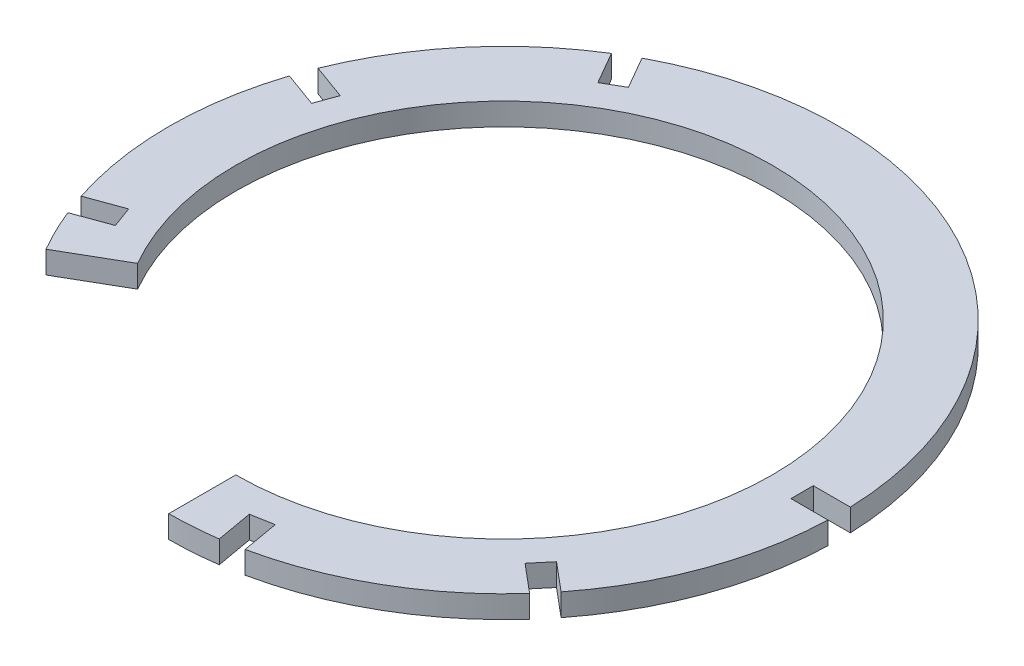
ISO-10303-21;
HEADER;
FILE_DESCRIPTION(('STEP AP214'),'2;1');
FILE_NAME('part.step','',(''),(''),'','','');
FILE_SCHEMA(('AUTOMOTIVE_DESIGN { 1 0 10303 214 1 1 1 1 }'));
ENDSEC;
DATA;
#1=APPLICATION_CONTEXT('core data for automotive mechanical design processes');
#2=APPLICATION_PROTOCOL_DEFINITION('international standard','automotive_design',2000,#1);
#3=PRODUCT_CONTEXT('',#1,'mechanical');
#4=PRODUCT('Part','Part','',(#3));
#5=PRODUCT_RELATED_PRODUCT_CATEGORY('part','',(#4));
#6=PRODUCT_DEFINITION_FORMATION('','',#4);
#7=PRODUCT_DEFINITION_CONTEXT('part definition',#1,'design');
#8=PRODUCT_DEFINITION('design','',#6,#7);
#9=PRODUCT_DEFINITION_SHAPE('','',#8);
#10=(LENGTH_UNIT() NAMED_UNIT(*) SI_UNIT(.MILLI.,.METRE.));
#11=(NAMED_UNIT(*) PLANE_ANGLE_UNIT() SI_UNIT($,.RADIAN.));
#12=(NAMED_UNIT(*) SI_UNIT($,.STERADIAN.) SOLID_ANGLE_UNIT());
#13=UNCERTAINTY_MEASURE_WITH_UNIT(LENGTH_MEASURE(1.E-05),#10,'distance_accuracy_value','');
#14=(GEOMETRIC_REPRESENTATION_CONTEXT(3) GLOBAL_UNCERTAINTY_ASSIGNED_CONTEXT((#13)) GLOBAL_UNIT_ASSIGNED_CONTEXT((#10,
#11,#12)) REPRESENTATION_CONTEXT('',''));
#15=CARTESIAN_POINT('',(0.,0.,0.));
#16=DIRECTION('',(0.,0.,1.));
#17=DIRECTION('',(1.,0.,0.));
#18=AXIS2_PLACEMENT_3D('',#15,#16,#17);
#19=CARTESIAN_POINT('',(0.,15.,0.));
#20=DIRECTION('',(0.,-1.,0.));
#21=DIRECTION('',(0.,0.,-1.));
#22=AXIS2_PLACEMENT_3D('',#19,#20,#21);
#23=CYLINDRICAL_SURFACE('',#22,225.);
#24=DIRECTION('',(0.,-1.,0.));
#25=VECTOR('',#24,1.);
#26=CARTESIAN_POINT('',(-213.878496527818,15.,-69.864073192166));
#27=LINE('',#26,#25);
#28=CARTESIAN_POINT('',(-213.878496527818,0.,-69.864073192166));
#29=VERTEX_POINT('',#28);
#30=CARTESIAN_POINT('',(-213.878496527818,15.,-69.864073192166));
#31=VERTEX_POINT('',#30);
#32=EDGE_CURVE('E338',#29,#31,#27,.F.);
#33=ORIENTED_EDGE('',*,*,#32,.F.);
#34=CARTESIAN_POINT('',(0.,0.,0.));
#35=DIRECTION('',(0.,1.,0.));
#36=DIRECTION('',(0.,0.,1.));
#37=AXIS2_PLACEMENT_3D('',#34,#35,#36);
#38=CIRCLE('',#37,225.);
#39=CARTESIAN_POINT('',(-213.878496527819,0.,69.8640731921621));
#40=VERTEX_POINT('',#39);
#41=EDGE_CURVE('E461',#29,#40,#38,.T.);
#42=ORIENTED_EDGE('',*,*,#41,.T.);
#43=DIRECTION('',(0.,-1.,0.));
#44=VECTOR('',#43,1.);
#45=CARTESIAN_POINT('',(-213.878496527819,15.,69.8640731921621));
#46=LINE('',#45,#44);
#47=CARTESIAN_POINT('',(-213.878496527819,15.,69.8640731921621));
#48=VERTEX_POINT('',#47);
#49=EDGE_CURVE('E48',#40,#48,#46,.F.);
#50=ORIENTED_EDGE('',*,*,#49,.T.);
#51=CARTESIAN_POINT('',(0.,15.,0.));
#52=DIRECTION('',(0.,1.,0.));
#53=DIRECTION('',(0.,0.,1.));
#54=AXIS2_PLACEMENT_3D('',#51,#52,#53);
#55=CIRCLE('',#54,225.);
#56=EDGE_CURVE('E447',#31,#48,#55,.T.);
#57=ORIENTED_EDGE('',*,*,#56,.F.);
#58=EDGE_LOOP('',(#33,#42,#50,#57));
#59=FACE_BOUND('',#58,.T.);
#60=ADVANCED_FACE('F33',(#59),#23,.T.);
#61=CARTESIAN_POINT('',(-118.932673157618,0.,-190.997432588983));
#62=VERTEX_POINT('',#61);
#63=CARTESIAN_POINT('',(-208.748194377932,0.,-83.9594625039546));
#64=VERTEX_POINT('',#63);
#65=EDGE_CURVE('E463',#62,#64,#38,.T.);
#66=ORIENTED_EDGE('',*,*,#65,.T.);
#67=DIRECTION('',(0.,-1.,0.));
#68=VECTOR('',#67,1.);
#69=CARTESIAN_POINT('',(-208.748194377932,15.,-83.9594625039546));
#70=LINE('',#69,#68);
#71=CARTESIAN_POINT('',(-208.748194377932,15.,-83.9594625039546));
#72=VERTEX_POINT('',#71);
#73=EDGE_CURVE('E56',#64,#72,#70,.F.);
#74=ORIENTED_EDGE('',*,*,#73,.T.);
#75=CARTESIAN_POINT('',(-118.932673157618,15.,-190.997432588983));
#76=VERTEX_POINT('',#75);
#77=EDGE_CURVE('E442',#76,#72,#55,.T.);
#78=ORIENTED_EDGE('',*,*,#77,.F.);
#79=DIRECTION('',(0.,-1.,0.));
#80=VECTOR('',#79,1.);
#81=CARTESIAN_POINT('',(-118.932673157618,15.,-190.997432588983));
#82=LINE('',#81,#80);
#83=EDGE_CURVE('E335',#62,#76,#82,.F.);
#84=ORIENTED_EDGE('',*,*,#83,.F.);
#85=EDGE_LOOP('',(#66,#74,#78,#84));
#86=FACE_BOUND('',#85,.T.);
#87=ADVANCED_FACE('F517',(#86),#23,.T.);
#88=DIRECTION('',(0.,-1.,0.));
#89=VECTOR('',#88,1.);
#90=CARTESIAN_POINT('',(-208.748194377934,15.,83.9594625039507));
#91=LINE('',#90,#89);
#92=CARTESIAN_POINT('',(-208.748194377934,0.,83.9594625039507));
#93=VERTEX_POINT('',#92);
#94=CARTESIAN_POINT('',(-208.748194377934,15.,83.9594625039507));
#95=VERTEX_POINT('',#94);
#96=EDGE_CURVE('E236',#93,#95,#91,.F.);
#97=ORIENTED_EDGE('',*,*,#96,.F.);
#98=CARTESIAN_POINT('',(-194.855715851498,0.,112.500000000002));
#99=VERTEX_POINT('',#98);
#100=EDGE_CURVE('E386',#93,#99,#38,.T.);
#101=ORIENTED_EDGE('',*,*,#100,.T.);
#102=DIRECTION('',(0.,-1.,0.));
#103=VECTOR('',#102,1.);
#104=CARTESIAN_POINT('',(-194.855715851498,15.,112.500000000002));
#105=LINE('',#104,#103);
#106=CARTESIAN_POINT('',(-194.855715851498,15.,112.500000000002));
#107=VERTEX_POINT('',#106);
#108=EDGE_CURVE('E395',#107,#99,#105,.T.);
#109=ORIENTED_EDGE('',*,*,#108,.F.);
#110=EDGE_CURVE('E373',#95,#107,#55,.T.);
#111=ORIENTED_EDGE('',*,*,#110,.F.);
#112=EDGE_LOOP('',(#97,#101,#109,#111));
#113=FACE_BOUND('',#112,.T.);
#114=ADVANCED_FACE('F455',(#113),#23,.T.);
#115=CARTESIAN_POINT('',(0.,15.,0.));
#116=DIRECTION('',(0.,1.,0.));
#117=DIRECTION('',(0.,0.,1.));
#118=AXIS2_PLACEMENT_3D('',#115,#116,#117);
#119=PLANE('',#118);
#120=DIRECTION('',(0.342020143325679,0.,-0.939692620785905));
#121=VECTOR('',#120,1.);
#122=CARTESIAN_POINT('',(-190.503675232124,15.,-61.3563340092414));
#123=LINE('',#122,#121);
#124=CARTESIAN_POINT('',(-190.503675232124,15.,-61.3563340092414));
#125=VERTEX_POINT('',#124);
#126=CARTESIAN_POINT('',(-185.373373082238,15.,-75.4517233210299));
#127=VERTEX_POINT('',#126);
#128=EDGE_CURVE('E230',#125,#127,#123,.T.);
#129=ORIENTED_EDGE('',*,*,#128,.F.);
#130=DIRECTION('',(-0.939692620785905,0.,-0.342020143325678));
#131=VECTOR('',#130,1.);
#132=CARTESIAN_POINT('',(-190.503675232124,15.,-61.3563340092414));
#133=LINE('',#132,#131);
#134=EDGE_CURVE('E280',#125,#31,#133,.T.);
#135=ORIENTED_EDGE('',*,*,#134,.T.);
#136=ORIENTED_EDGE('',*,*,#56,.T.);
#137=DIRECTION('',(-0.939692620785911,0.,0.342020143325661));
#138=VECTOR('',#137,1.);
#139=CARTESIAN_POINT('',(-190.503675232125,15.,61.3563340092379));
#140=LINE('',#139,#138);
#141=CARTESIAN_POINT('',(-190.503675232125,15.,61.3563340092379));
#142=VERTEX_POINT('',#141);
#143=EDGE_CURVE('E239',#142,#48,#140,.T.);
#144=ORIENTED_EDGE('',*,*,#143,.F.);
#145=DIRECTION('',(-0.342020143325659,0.,-0.939692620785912));
#146=VECTOR('',#145,1.);
#147=CARTESIAN_POINT('',(-185.37337308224,15.,75.4517233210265));
#148=LINE('',#147,#146);
#149=CARTESIAN_POINT('',(-185.37337308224,15.,75.4517233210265));
#150=VERTEX_POINT('',#149);
#151=EDGE_CURVE('E223',#150,#142,#148,.T.);
#152=ORIENTED_EDGE('',*,*,#151,.F.);
#153=DIRECTION('',(-0.939692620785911,0.,0.342020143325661));
#154=VECTOR('',#153,1.);
#155=CARTESIAN_POINT('',(-185.37337308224,15.,75.4517233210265));
#156=LINE('',#155,#154);
#157=EDGE_CURVE('E233',#150,#95,#156,.T.);
#158=ORIENTED_EDGE('',*,*,#157,.T.);
#159=ORIENTED_EDGE('',*,*,#110,.T.);
#160=DIRECTION('',(0.866025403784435,0.,-0.500000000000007));
#161=VECTOR('',#160,1.);
#162=CARTESIAN_POINT('',(-155.884572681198,15.,90.0000000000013));
#163=LINE('',#162,#161);
#164=CARTESIAN_POINT('',(-155.884572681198,15.,90.0000000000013));
#165=VERTEX_POINT('',#164);
#166=EDGE_CURVE('E377',#107,#165,#163,.T.);
#167=ORIENTED_EDGE('',*,*,#166,.T.);
#168=CARTESIAN_POINT('',(0.,15.,0.));
#169=DIRECTION('',(0.,-1.,0.));
#170=DIRECTION('',(0.,0.,1.));
#171=AXIS2_PLACEMENT_3D('',#168,#169,#170);
#172=CIRCLE('',#171,180.);
#173=CARTESIAN_POINT('',(1.96370697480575E-12,15.,180.));
#174=VERTEX_POINT('',#173);
#175=EDGE_CURVE('E367',#165,#174,#172,.T.);
#176=ORIENTED_EDGE('',*,*,#175,.T.);
#177=DIRECTION('',(0.,0.,1.));
#178=VECTOR('',#177,1.);
#179=CARTESIAN_POINT('',(1.96370697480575E-12,15.,180.));
#180=LINE('',#179,#178);
#181=CARTESIAN_POINT('',(2.45456432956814E-12,15.,225.));
#182=VERTEX_POINT('',#181);
#183=EDGE_CURVE('E370',#174,#182,#180,.T.);
#184=ORIENTED_EDGE('',*,*,#183,.T.);
#185=CARTESIAN_POINT('',(31.6630697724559,15.,222.760970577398));
#186=VERTEX_POINT('',#185);
#187=EDGE_CURVE('E374',#182,#186,#55,.T.);
#188=ORIENTED_EDGE('',*,*,#187,.T.);
#189=DIRECTION('',(0.173648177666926,0.,0.984807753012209));
#190=VECTOR('',#189,1.);
#191=CARTESIAN_POINT('',(27.3435773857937,15.,198.263911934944));
#192=LINE('',#191,#190);
#193=CARTESIAN_POINT('',(27.3435773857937,15.,198.263911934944));
#194=VERTEX_POINT('',#193);
#195=EDGE_CURVE('E319',#194,#186,#192,.T.);
#196=ORIENTED_EDGE('',*,*,#195,.F.);
#197=DIRECTION('',(-0.984807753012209,0.,0.173648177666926));
#198=VECTOR('',#197,1.);
#199=CARTESIAN_POINT('',(42.1156936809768,15.,195.65918926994));
#200=LINE('',#199,#198);
#201=CARTESIAN_POINT('',(42.1156936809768,15.,195.65918926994));
#202=VERTEX_POINT('',#201);
#203=EDGE_CURVE('E298',#202,#194,#200,.T.);
#204=ORIENTED_EDGE('',*,*,#203,.F.);
#205=DIRECTION('',(0.173648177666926,0.,0.984807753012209));
#206=VECTOR('',#205,1.);
#207=CARTESIAN_POINT('',(42.1156936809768,15.,195.65918926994));
#208=LINE('',#207,#206);
#209=CARTESIAN_POINT('',(46.435186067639,15.,220.156247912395));
#210=VERTEX_POINT('',#209);
#211=EDGE_CURVE('E316',#202,#210,#208,.T.);
#212=ORIENTED_EDGE('',*,*,#211,.T.);
#213=CARTESIAN_POINT('',(167.443310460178,15.,150.292174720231));
#214=VERTEX_POINT('',#213);
#215=EDGE_CURVE('E378',#210,#214,#55,.T.);
#216=ORIENTED_EDGE('',*,*,#215,.T.);
#217=DIRECTION('',(0.766044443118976,0.,0.642787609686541));
#218=VECTOR('',#217,1.);
#219=CARTESIAN_POINT('',(148.387981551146,15.,134.302855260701));
#220=LINE('',#219,#218);
#221=CARTESIAN_POINT('',(148.387981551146,15.,134.302855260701));
#222=VERTEX_POINT('',#221);
#223=EDGE_CURVE('E302',#222,#214,#220,.T.);
#224=ORIENTED_EDGE('',*,*,#223,.F.);
#225=DIRECTION('',(-0.642787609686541,0.,0.766044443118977));
#226=VECTOR('',#225,1.);
#227=CARTESIAN_POINT('',(158.029795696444,15.,122.812188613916));
#228=LINE('',#227,#226);
#229=CARTESIAN_POINT('',(158.029795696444,15.,122.812188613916));
#230=VERTEX_POINT('',#229);
#231=EDGE_CURVE('E305',#230,#222,#228,.T.);
#232=ORIENTED_EDGE('',*,*,#231,.F.);
#233=DIRECTION('',(0.766044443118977,0.,0.642787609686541));
#234=VECTOR('',#233,1.);
#235=CARTESIAN_POINT('',(158.029795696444,15.,122.812188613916));
#236=LINE('',#235,#234);
#237=CARTESIAN_POINT('',(177.085124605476,15.,138.801508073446));
#238=VERTEX_POINT('',#237);
#239=EDGE_CURVE('E299',#230,#238,#236,.T.);
#240=ORIENTED_EDGE('',*,*,#239,.T.);
#241=CARTESIAN_POINT('',(224.874965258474,15.,7.5));
#242=VERTEX_POINT('',#241);
#243=EDGE_CURVE('E441',#238,#242,#55,.T.);
#244=ORIENTED_EDGE('',*,*,#243,.T.);
#245=DIRECTION('',(1.,0.,0.));
#246=VECTOR('',#245,1.);
#247=CARTESIAN_POINT('',(200.,15.,7.5));
#248=LINE('',#247,#246);
#249=CARTESIAN_POINT('',(200.,15.,7.5));
#250=VERTEX_POINT('',#249);
#251=EDGE_CURVE('E353',#250,#242,#248,.T.);
#252=ORIENTED_EDGE('',*,*,#251,.F.);
#253=DIRECTION('',(0.,0.,1.));
#254=VECTOR('',#253,1.);
#255=CARTESIAN_POINT('',(200.,15.,-7.5));
#256=LINE('',#255,#254);
#257=CARTESIAN_POINT('',(200.,15.,-7.5));
#258=VERTEX_POINT('',#257);
#259=EDGE_CURVE('E340',#258,#250,#256,.T.);
#260=ORIENTED_EDGE('',*,*,#259,.F.);
#261=DIRECTION('',(1.,0.,0.));
#262=VECTOR('',#261,1.);
#263=CARTESIAN_POINT('',(200.,15.,-7.5));
#264=LINE('',#263,#262);
#265=CARTESIAN_POINT('',(224.874965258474,15.,-7.5));
#266=VERTEX_POINT('',#265);
#267=EDGE_CURVE('E345',#258,#266,#264,.T.);
#268=ORIENTED_EDGE('',*,*,#267,.T.);
#269=CARTESIAN_POINT('',(-105.942292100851,15.,-198.497432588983));
#270=VERTEX_POINT('',#269);
#271=EDGE_CURVE('E379',#266,#270,#55,.T.);
#272=ORIENTED_EDGE('',*,*,#271,.T.);
#273=DIRECTION('',(-0.499999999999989,0.,-0.866025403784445));
#274=VECTOR('',#273,1.);
#275=CARTESIAN_POINT('',(-93.5048094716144,15.,-176.955080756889));
#276=LINE('',#275,#274);
#277=CARTESIAN_POINT('',(-93.5048094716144,15.,-176.955080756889));
#278=VERTEX_POINT('',#277);
#279=EDGE_CURVE('E263',#278,#270,#276,.T.);
#280=ORIENTED_EDGE('',*,*,#279,.F.);
#281=DIRECTION('',(0.866025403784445,0.,-0.499999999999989));
#282=VECTOR('',#281,1.);
#283=CARTESIAN_POINT('',(-106.495190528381,15.,-169.455080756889));
#284=LINE('',#283,#282);
#285=CARTESIAN_POINT('',(-106.495190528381,15.,-169.455080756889));
#286=VERTEX_POINT('',#285);
#287=EDGE_CURVE('E266',#286,#278,#284,.T.);
#288=ORIENTED_EDGE('',*,*,#287,.F.);
#289=DIRECTION('',(-0.499999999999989,0.,-0.866025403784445));
#290=VECTOR('',#289,1.);
#291=CARTESIAN_POINT('',(-106.495190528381,15.,-169.455080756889));
#292=LINE('',#291,#290);
#293=EDGE_CURVE('E260',#286,#76,#292,.T.);
#294=ORIENTED_EDGE('',*,*,#293,.T.);
#295=ORIENTED_EDGE('',*,*,#77,.T.);
#296=DIRECTION('',(-0.939692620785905,0.,-0.342020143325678));
#297=VECTOR('',#296,1.);
#298=CARTESIAN_POINT('',(-185.373373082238,15.,-75.4517233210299));
#299=LINE('',#298,#297);
#300=EDGE_CURVE('E283',#127,#72,#299,.T.);
#301=ORIENTED_EDGE('',*,*,#300,.F.);
#302=EDGE_LOOP('',(#129,#135,#136,#144,#152,#158,#159,#167,#176,#184,#188,#196,#204,#212,#216,
#224,#232,#240,#244,#252,#260,#268,#272,#280,#288,#294,#295,#301));
#303=FACE_BOUND('',#302,.T.);
#304=ADVANCED_FACE('F242',(#303),#119,.T.);
#305=CARTESIAN_POINT('',(0.,0.,0.));
#306=DIRECTION('',(0.,1.,0.));
#307=DIRECTION('',(0.,0.,1.));
#308=AXIS2_PLACEMENT_3D('',#305,#306,#307);
#309=PLANE('',#308);
#310=DIRECTION('',(-0.939692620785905,0.,-0.342020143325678));
#311=VECTOR('',#310,1.);
#312=CARTESIAN_POINT('',(-190.503675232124,0.,-61.3563340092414));
#313=LINE('',#312,#311);
#314=CARTESIAN_POINT('',(-190.503675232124,0.,-61.3563340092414));
#315=VERTEX_POINT('',#314);
#316=EDGE_CURVE('E278',#315,#29,#313,.T.);
#317=ORIENTED_EDGE('',*,*,#316,.F.);
#318=DIRECTION('',(0.342020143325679,0.,-0.939692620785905));
#319=VECTOR('',#318,1.);
#320=CARTESIAN_POINT('',(-190.503675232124,0.,-61.3563340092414));
#321=LINE('',#320,#319);
#322=CARTESIAN_POINT('',(-185.373373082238,0.,-75.4517233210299));
#323=VERTEX_POINT('',#322);
#324=EDGE_CURVE('E284',#315,#323,#321,.T.);
#325=ORIENTED_EDGE('',*,*,#324,.T.);
#326=DIRECTION('',(-0.939692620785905,0.,-0.342020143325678));
#327=VECTOR('',#326,1.);
#328=CARTESIAN_POINT('',(-185.373373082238,0.,-75.4517233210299));
#329=LINE('',#328,#327);
#330=EDGE_CURVE('E289',#323,#64,#329,.T.);
#331=ORIENTED_EDGE('',*,*,#330,.T.);
#332=ORIENTED_EDGE('',*,*,#65,.F.);
#333=DIRECTION('',(-0.499999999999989,0.,-0.866025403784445));
#334=VECTOR('',#333,1.);
#335=CARTESIAN_POINT('',(-106.495190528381,0.,-169.455080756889));
#336=LINE('',#335,#334);
#337=CARTESIAN_POINT('',(-106.495190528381,0.,-169.455080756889));
#338=VERTEX_POINT('',#337);
#339=EDGE_CURVE('E257',#338,#62,#336,.T.);
#340=ORIENTED_EDGE('',*,*,#339,.F.);
#341=DIRECTION('',(0.866025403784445,0.,-0.499999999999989));
#342=VECTOR('',#341,1.);
#343=CARTESIAN_POINT('',(-106.495190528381,0.,-169.455080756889));
#344=LINE('',#343,#342);
#345=CARTESIAN_POINT('',(-93.5048094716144,0.,-176.955080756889));
#346=VERTEX_POINT('',#345);
#347=EDGE_CURVE('E264',#338,#346,#344,.T.);
#348=ORIENTED_EDGE('',*,*,#347,.T.);
#349=DIRECTION('',(-0.499999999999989,0.,-0.866025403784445));
#350=VECTOR('',#349,1.);
#351=CARTESIAN_POINT('',(-93.5048094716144,0.,-176.955080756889));
#352=LINE('',#351,#350);
#353=CARTESIAN_POINT('',(-105.942292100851,0.,-198.497432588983));
#354=VERTEX_POINT('',#353);
#355=EDGE_CURVE('E271',#346,#354,#352,.T.);
#356=ORIENTED_EDGE('',*,*,#355,.T.);
#357=CARTESIAN_POINT('',(224.874965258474,0.,-7.5));
#358=VERTEX_POINT('',#357);
#359=EDGE_CURVE('E391',#358,#354,#38,.T.);
#360=ORIENTED_EDGE('',*,*,#359,.F.);
#361=DIRECTION('',(1.,0.,0.));
#362=VECTOR('',#361,1.);
#363=CARTESIAN_POINT('',(200.,0.,-7.5));
#364=LINE('',#363,#362);
#365=CARTESIAN_POINT('',(200.,0.,-7.5));
#366=VERTEX_POINT('',#365);
#367=EDGE_CURVE('E348',#366,#358,#364,.T.);
#368=ORIENTED_EDGE('',*,*,#367,.F.);
#369=DIRECTION('',(0.,0.,1.));
#370=VECTOR('',#369,1.);
#371=CARTESIAN_POINT('',(200.,0.,-7.5));
#372=LINE('',#371,#370);
#373=CARTESIAN_POINT('',(200.,0.,7.5));
#374=VERTEX_POINT('',#373);
#375=EDGE_CURVE('E341',#366,#374,#372,.T.);
#376=ORIENTED_EDGE('',*,*,#375,.T.);
#377=DIRECTION('',(1.,0.,0.));
#378=VECTOR('',#377,1.);
#379=CARTESIAN_POINT('',(200.,0.,7.5));
#380=LINE('',#379,#378);
#381=CARTESIAN_POINT('',(224.874965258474,0.,7.5));
#382=VERTEX_POINT('',#381);
#383=EDGE_CURVE('E344',#374,#382,#380,.T.);
#384=ORIENTED_EDGE('',*,*,#383,.T.);
#385=CARTESIAN_POINT('',(177.085124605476,0.,138.801508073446));
#386=VERTEX_POINT('',#385);
#387=EDGE_CURVE('E468',#386,#382,#38,.T.);
#388=ORIENTED_EDGE('',*,*,#387,.F.);
#389=DIRECTION('',(0.766044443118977,0.,0.642787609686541));
#390=VECTOR('',#389,1.);
#391=CARTESIAN_POINT('',(158.029795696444,0.,122.812188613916));
#392=LINE('',#391,#390);
#393=CARTESIAN_POINT('',(158.029795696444,0.,122.812188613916));
#394=VERTEX_POINT('',#393);
#395=EDGE_CURVE('E295',#394,#386,#392,.T.);
#396=ORIENTED_EDGE('',*,*,#395,.F.);
#397=DIRECTION('',(-0.642787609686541,0.,0.766044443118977));
#398=VECTOR('',#397,1.);
#399=CARTESIAN_POINT('',(158.029795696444,0.,122.812188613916));
#400=LINE('',#399,#398);
#401=CARTESIAN_POINT('',(148.387981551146,0.,134.302855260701));
#402=VERTEX_POINT('',#401);
#403=EDGE_CURVE('E303',#394,#402,#400,.T.);
#404=ORIENTED_EDGE('',*,*,#403,.T.);
#405=DIRECTION('',(0.766044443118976,0.,0.642787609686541));
#406=VECTOR('',#405,1.);
#407=CARTESIAN_POINT('',(148.387981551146,0.,134.302855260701));
#408=LINE('',#407,#406);
#409=CARTESIAN_POINT('',(167.443310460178,0.,150.292174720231));
#410=VERTEX_POINT('',#409);
#411=EDGE_CURVE('E309',#402,#410,#408,.T.);
#412=ORIENTED_EDGE('',*,*,#411,.T.);
#413=CARTESIAN_POINT('',(46.435186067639,0.,220.156247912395));
#414=VERTEX_POINT('',#413);
#415=EDGE_CURVE('E390',#414,#410,#38,.T.);
#416=ORIENTED_EDGE('',*,*,#415,.F.);
#417=DIRECTION('',(0.173648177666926,0.,0.984807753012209));
#418=VECTOR('',#417,1.);
#419=CARTESIAN_POINT('',(42.1156936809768,0.,195.65918926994));
#420=LINE('',#419,#418);
#421=CARTESIAN_POINT('',(42.1156936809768,0.,195.65918926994));
#422=VERTEX_POINT('',#421);
#423=EDGE_CURVE('E314',#422,#414,#420,.T.);
#424=ORIENTED_EDGE('',*,*,#423,.F.);
#425=DIRECTION('',(-0.984807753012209,0.,0.173648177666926));
#426=VECTOR('',#425,1.);
#427=CARTESIAN_POINT('',(42.1156936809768,0.,195.65918926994));
#428=LINE('',#427,#426);
#429=CARTESIAN_POINT('',(27.3435773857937,0.,198.263911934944));
#430=VERTEX_POINT('',#429);
#431=EDGE_CURVE('E320',#422,#430,#428,.T.);
#432=ORIENTED_EDGE('',*,*,#431,.T.);
#433=DIRECTION('',(0.173648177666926,0.,0.984807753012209));
#434=VECTOR('',#433,1.);
#435=CARTESIAN_POINT('',(27.3435773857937,0.,198.263911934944));
#436=LINE('',#435,#434);
#437=CARTESIAN_POINT('',(31.6630697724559,0.,222.760970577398));
#438=VERTEX_POINT('',#437);
#439=EDGE_CURVE('E325',#430,#438,#436,.T.);
#440=ORIENTED_EDGE('',*,*,#439,.T.);
#441=CARTESIAN_POINT('',(2.45456432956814E-12,0.,225.));
#442=VERTEX_POINT('',#441);
#443=EDGE_CURVE('E387',#442,#438,#38,.T.);
#444=ORIENTED_EDGE('',*,*,#443,.F.);
#445=DIRECTION('',(0.,0.,1.));
#446=VECTOR('',#445,1.);
#447=CARTESIAN_POINT('',(1.96370697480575E-12,0.,180.));
#448=LINE('',#447,#446);
#449=CARTESIAN_POINT('',(1.96370697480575E-12,0.,180.));
#450=VERTEX_POINT('',#449);
#451=EDGE_CURVE('E384',#450,#442,#448,.T.);
#452=ORIENTED_EDGE('',*,*,#451,.F.);
#453=CARTESIAN_POINT('',(0.,0.,0.));
#454=DIRECTION('',(0.,-1.,0.));
#455=DIRECTION('',(0.,0.,1.));
#456=AXIS2_PLACEMENT_3D('',#453,#454,#455);
#457=CIRCLE('',#456,180.);
#458=CARTESIAN_POINT('',(-155.884572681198,0.,90.0000000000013));
#459=VERTEX_POINT('',#458);
#460=EDGE_CURVE('E366',#459,#450,#457,.T.);
#461=ORIENTED_EDGE('',*,*,#460,.F.);
#462=DIRECTION('',(0.866025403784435,0.,-0.500000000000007));
#463=VECTOR('',#462,1.);
#464=CARTESIAN_POINT('',(-155.884572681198,0.,90.0000000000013));
#465=LINE('',#464,#463);
#466=EDGE_CURVE('E371',#99,#459,#465,.T.);
#467=ORIENTED_EDGE('',*,*,#466,.F.);
#468=ORIENTED_EDGE('',*,*,#100,.F.);
#469=DIRECTION('',(-0.939692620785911,0.,0.342020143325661));
#470=VECTOR('',#469,1.);
#471=CARTESIAN_POINT('',(-185.37337308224,0.,75.4517233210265));
#472=LINE('',#471,#470);
#473=CARTESIAN_POINT('',(-185.37337308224,0.,75.4517233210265));
#474=VERTEX_POINT('',#473);
#475=EDGE_CURVE('E250',#474,#93,#472,.T.);
#476=ORIENTED_EDGE('',*,*,#475,.F.);
#477=DIRECTION('',(-0.342020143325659,0.,-0.939692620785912));
#478=VECTOR('',#477,1.);
#479=CARTESIAN_POINT('',(-185.37337308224,0.,75.4517233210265));
#480=LINE('',#479,#478);
#481=CARTESIAN_POINT('',(-190.503675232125,0.,61.3563340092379));
#482=VERTEX_POINT('',#481);
#483=EDGE_CURVE('E226',#474,#482,#480,.T.);
#484=ORIENTED_EDGE('',*,*,#483,.T.);
#485=DIRECTION('',(-0.939692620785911,0.,0.342020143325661));
#486=VECTOR('',#485,1.);
#487=CARTESIAN_POINT('',(-190.503675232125,0.,61.3563340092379));
#488=LINE('',#487,#486);
#489=EDGE_CURVE('E252',#482,#40,#488,.T.);
#490=ORIENTED_EDGE('',*,*,#489,.T.);
#491=ORIENTED_EDGE('',*,*,#41,.F.);
#492=EDGE_LOOP('',(#317,#325,#331,#332,#340,#348,#356,#360,#368,#376,#384,#388,#396,#404,#412,
#416,#424,#432,#440,#444,#452,#461,#467,#468,#476,#484,#490,#491));
#493=FACE_BOUND('',#492,.T.);
#494=ADVANCED_FACE('F424',(#493),#309,.F.);
#495=DIRECTION('',(0.,-1.,0.));
#496=VECTOR('',#495,1.);
#497=CARTESIAN_POINT('',(46.435186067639,15.,220.156247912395));
#498=LINE('',#497,#496);
#499=EDGE_CURVE('E11',#414,#210,#498,.F.);
#500=ORIENTED_EDGE('',*,*,#499,.F.);
#501=ORIENTED_EDGE('',*,*,#415,.T.);
#502=DIRECTION('',(0.,-1.,0.));
#503=VECTOR('',#502,1.);
#504=CARTESIAN_POINT('',(167.443310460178,15.,150.292174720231));
#505=LINE('',#504,#503);
#506=EDGE_CURVE('E404',#410,#214,#505,.F.);
#507=ORIENTED_EDGE('',*,*,#506,.T.);
#508=ORIENTED_EDGE('',*,*,#215,.F.);
#509=EDGE_LOOP('',(#500,#501,#507,#508));
#510=FACE_BOUND('',#509,.T.);
#511=ADVANCED_FACE('F438',(#510),#23,.T.);
#512=DIRECTION('',(0.,-1.,0.));
#513=VECTOR('',#512,1.);
#514=CARTESIAN_POINT('',(177.085124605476,15.,138.801508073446));
#515=LINE('',#514,#513);
#516=EDGE_CURVE('E407',#386,#238,#515,.F.);
#517=ORIENTED_EDGE('',*,*,#516,.F.);
#518=ORIENTED_EDGE('',*,*,#387,.T.);
#519=DIRECTION('',(0.,-1.,0.));
#520=VECTOR('',#519,1.);
#521=CARTESIAN_POINT('',(224.874965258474,15.,7.5));
#522=LINE('',#521,#520);
#523=EDGE_CURVE('E360',#382,#242,#522,.F.);
#524=ORIENTED_EDGE('',*,*,#523,.T.);
#525=ORIENTED_EDGE('',*,*,#243,.F.);
#526=EDGE_LOOP('',(#517,#518,#524,#525));
#527=FACE_BOUND('',#526,.T.);
#528=ADVANCED_FACE('F489',(#527),#23,.T.);
#529=ORIENTED_EDGE('',*,*,#359,.T.);
#530=DIRECTION('',(0.,-1.,0.));
#531=VECTOR('',#530,1.);
#532=CARTESIAN_POINT('',(-105.942292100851,15.,-198.497432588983));
#533=LINE('',#532,#531);
#534=EDGE_CURVE('E332',#354,#270,#533,.F.);
#535=ORIENTED_EDGE('',*,*,#534,.T.);
#536=ORIENTED_EDGE('',*,*,#271,.F.);
#537=DIRECTION('',(0.,-1.,0.));
#538=VECTOR('',#537,1.);
#539=CARTESIAN_POINT('',(224.874965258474,15.,-7.5));
#540=LINE('',#539,#538);
#541=EDGE_CURVE('E364',#358,#266,#540,.F.);
#542=ORIENTED_EDGE('',*,*,#541,.F.);
#543=EDGE_LOOP('',(#529,#535,#536,#542));
#544=FACE_BOUND('',#543,.T.);
#545=ADVANCED_FACE('F505',(#544),#23,.T.);
#546=CARTESIAN_POINT('',(0.,15.,0.));
#547=DIRECTION('',(0.,-1.,0.));
#548=DIRECTION('',(0.,0.,-1.));
#549=AXIS2_PLACEMENT_3D('',#546,#547,#548);
#550=CYLINDRICAL_SURFACE('',#549,180.);
#551=ORIENTED_EDGE('',*,*,#460,.T.);
#552=DIRECTION('',(0.,-1.,0.));
#553=VECTOR('',#552,1.);
#554=CARTESIAN_POINT('',(1.96370697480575E-12,15.,180.));
#555=LINE('',#554,#553);
#556=EDGE_CURVE('E401',#174,#450,#555,.T.);
#557=ORIENTED_EDGE('',*,*,#556,.F.);
#558=ORIENTED_EDGE('',*,*,#175,.F.);
#559=DIRECTION('',(0.,-1.,0.));
#560=VECTOR('',#559,1.);
#561=CARTESIAN_POINT('',(-155.884572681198,15.,90.0000000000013));
#562=LINE('',#561,#560);
#563=EDGE_CURVE('E381',#165,#459,#562,.T.);
#564=ORIENTED_EDGE('',*,*,#563,.T.);
#565=EDGE_LOOP('',(#551,#557,#558,#564));
#566=FACE_BOUND('',#565,.T.);
#567=ADVANCED_FACE('F35',(#566),#550,.F.);
#568=CARTESIAN_POINT('',(1.96370697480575E-12,15.,180.));
#569=DIRECTION('',(1.,0.,0.));
#570=DIRECTION('',(0.,0.,-1.));
#571=AXIS2_PLACEMENT_3D('',#568,#569,#570);
#572=PLANE('',#571);
#573=ORIENTED_EDGE('',*,*,#451,.T.);
#574=DIRECTION('',(0.,-1.,0.));
#575=VECTOR('',#574,1.);
#576=CARTESIAN_POINT('',(2.45456432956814E-12,15.,225.));
#577=LINE('',#576,#575);
#578=EDGE_CURVE('E398',#182,#442,#577,.T.);
#579=ORIENTED_EDGE('',*,*,#578,.F.);
#580=ORIENTED_EDGE('',*,*,#183,.F.);
#581=ORIENTED_EDGE('',*,*,#556,.T.);
#582=EDGE_LOOP('',(#573,#579,#580,#581));
#583=FACE_BOUND('',#582,.T.);
#584=ADVANCED_FACE('F421',(#583),#572,.F.);
#585=ORIENTED_EDGE('',*,*,#443,.T.);
#586=DIRECTION('',(0.,-1.,0.));
#587=VECTOR('',#586,1.);
#588=CARTESIAN_POINT('',(31.6630697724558,15.,222.760970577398));
#589=LINE('',#588,#587);
#590=EDGE_CURVE('E41',#438,#186,#589,.F.);
#591=ORIENTED_EDGE('',*,*,#590,.T.);
#592=ORIENTED_EDGE('',*,*,#187,.F.);
#593=ORIENTED_EDGE('',*,*,#578,.T.);
#594=EDGE_LOOP('',(#585,#591,#592,#593));
#595=FACE_BOUND('',#594,.T.);
#596=ADVANCED_FACE('F411',(#595),#23,.T.);
#597=CARTESIAN_POINT('',(-155.884572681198,15.,90.0000000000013));
#598=DIRECTION('',(-0.500000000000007,0.,-0.866025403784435));
#599=DIRECTION('',(-0.866025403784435,0.,0.500000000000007));
#600=AXIS2_PLACEMENT_3D('',#597,#598,#599);
#601=PLANE('',#600);
#602=ORIENTED_EDGE('',*,*,#466,.T.);
#603=ORIENTED_EDGE('',*,*,#563,.F.);
#604=ORIENTED_EDGE('',*,*,#166,.F.);
#605=ORIENTED_EDGE('',*,*,#108,.T.);
#606=EDGE_LOOP('',(#602,#603,#604,#605));
#607=FACE_BOUND('',#606,.T.);
#608=ADVANCED_FACE('F459',(#607),#601,.F.);
#609=CARTESIAN_POINT('',(200.,0.,-7.5));
#610=DIRECTION('',(0.,0.,1.));
#611=DIRECTION('',(1.,0.,0.));
#612=AXIS2_PLACEMENT_3D('',#609,#610,#611);
#613=PLANE('',#612);
#614=ORIENTED_EDGE('',*,*,#541,.T.);
#615=ORIENTED_EDGE('',*,*,#267,.F.);
#616=DIRECTION('',(0.,1.,0.));
#617=VECTOR('',#616,1.);
#618=CARTESIAN_POINT('',(200.,0.,-7.5));
#619=LINE('',#618,#617);
#620=EDGE_CURVE('E358',#366,#258,#619,.T.);
#621=ORIENTED_EDGE('',*,*,#620,.F.);
#622=ORIENTED_EDGE('',*,*,#367,.T.);
#623=EDGE_LOOP('',(#614,#615,#621,#622));
#624=FACE_BOUND('',#623,.T.);
#625=ADVANCED_FACE('F501',(#624),#613,.T.);
#626=CARTESIAN_POINT('',(200.,0.,7.5));
#627=DIRECTION('',(0.,0.,1.));
#628=DIRECTION('',(1.,0.,0.));
#629=AXIS2_PLACEMENT_3D('',#626,#627,#628);
#630=PLANE('',#629);
#631=ORIENTED_EDGE('',*,*,#383,.F.);
#632=DIRECTION('',(0.,1.,0.));
#633=VECTOR('',#632,1.);
#634=CARTESIAN_POINT('',(200.,0.,7.5));
#635=LINE('',#634,#633);
#636=EDGE_CURVE('E350',#374,#250,#635,.T.);
#637=ORIENTED_EDGE('',*,*,#636,.T.);
#638=ORIENTED_EDGE('',*,*,#251,.T.);
#639=ORIENTED_EDGE('',*,*,#523,.F.);
#640=EDGE_LOOP('',(#631,#637,#638,#639));
#641=FACE_BOUND('',#640,.T.);
#642=ADVANCED_FACE('F494',(#641),#630,.F.);
#643=CARTESIAN_POINT('',(200.,0.,-7.5));
#644=DIRECTION('',(-1.,0.,0.));
#645=DIRECTION('',(0.,0.,1.));
#646=AXIS2_PLACEMENT_3D('',#643,#644,#645);
#647=PLANE('',#646);
#648=ORIENTED_EDGE('',*,*,#259,.T.);
#649=ORIENTED_EDGE('',*,*,#636,.F.);
#650=ORIENTED_EDGE('',*,*,#375,.F.);
#651=ORIENTED_EDGE('',*,*,#620,.T.);
#652=EDGE_LOOP('',(#648,#649,#650,#651));
#653=FACE_BOUND('',#652,.T.);
#654=ADVANCED_FACE('F499',(#653),#647,.F.);
#655=CARTESIAN_POINT('',(158.029795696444,0.,122.812188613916));
#656=DIRECTION('',(-0.642787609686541,0.,0.766044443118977));
#657=DIRECTION('',(0.766044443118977,0.,0.642787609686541));
#658=AXIS2_PLACEMENT_3D('',#655,#656,#657);
#659=PLANE('',#658);
#660=ORIENTED_EDGE('',*,*,#516,.T.);
#661=ORIENTED_EDGE('',*,*,#239,.F.);
#662=DIRECTION('',(0.,1.,0.));
#663=VECTOR('',#662,1.);
#664=CARTESIAN_POINT('',(158.029795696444,0.,122.812188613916));
#665=LINE('',#664,#663);
#666=EDGE_CURVE('E296',#394,#230,#665,.T.);
#667=ORIENTED_EDGE('',*,*,#666,.F.);
#668=ORIENTED_EDGE('',*,*,#395,.T.);
#669=EDGE_LOOP('',(#660,#661,#667,#668));
#670=FACE_BOUND('',#669,.T.);
#671=ADVANCED_FACE('F488',(#670),#659,.T.);
#672=CARTESIAN_POINT('',(148.387981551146,0.,134.302855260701));
#673=DIRECTION('',(-0.642787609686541,0.,0.766044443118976));
#674=DIRECTION('',(0.766044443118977,0.,0.642787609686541));
#675=AXIS2_PLACEMENT_3D('',#672,#673,#674);
#676=PLANE('',#675);
#677=ORIENTED_EDGE('',*,*,#411,.F.);
#678=DIRECTION('',(0.,1.,0.));
#679=VECTOR('',#678,1.);
#680=CARTESIAN_POINT('',(148.387981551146,0.,134.302855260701));
#681=LINE('',#680,#679);
#682=EDGE_CURVE('E293',#402,#222,#681,.T.);
#683=ORIENTED_EDGE('',*,*,#682,.T.);
#684=ORIENTED_EDGE('',*,*,#223,.T.);
#685=ORIENTED_EDGE('',*,*,#506,.F.);
#686=EDGE_LOOP('',(#677,#683,#684,#685));
#687=FACE_BOUND('',#686,.T.);
#688=ADVANCED_FACE('F481',(#687),#676,.F.);
#689=CARTESIAN_POINT('',(158.029795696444,0.,122.812188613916));
#690=DIRECTION('',(-0.766044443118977,0.,-0.642787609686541));
#691=DIRECTION('',(-0.642787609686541,0.,0.766044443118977));
#692=AXIS2_PLACEMENT_3D('',#689,#690,#691);
#693=PLANE('',#692);
#694=ORIENTED_EDGE('',*,*,#231,.T.);
#695=ORIENTED_EDGE('',*,*,#682,.F.);
#696=ORIENTED_EDGE('',*,*,#403,.F.);
#697=ORIENTED_EDGE('',*,*,#666,.T.);
#698=EDGE_LOOP('',(#694,#695,#696,#697));
#699=FACE_BOUND('',#698,.T.);
#700=ADVANCED_FACE('F486',(#699),#693,.F.);
#701=CARTESIAN_POINT('',(42.1156936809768,0.,195.65918926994));
#702=DIRECTION('',(-0.984807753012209,0.,0.173648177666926));
#703=DIRECTION('',(0.173648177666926,0.,0.984807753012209));
#704=AXIS2_PLACEMENT_3D('',#701,#702,#703);
#705=PLANE('',#704);
#706=ORIENTED_EDGE('',*,*,#499,.T.);
#707=ORIENTED_EDGE('',*,*,#211,.F.);
#708=DIRECTION('',(0.,1.,0.));
#709=VECTOR('',#708,1.);
#710=CARTESIAN_POINT('',(42.1156936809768,0.,195.65918926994));
#711=LINE('',#710,#709);
#712=EDGE_CURVE('E244',#422,#202,#711,.T.);
#713=ORIENTED_EDGE('',*,*,#712,.F.);
#714=ORIENTED_EDGE('',*,*,#423,.T.);
#715=EDGE_LOOP('',(#706,#707,#713,#714));
#716=FACE_BOUND('',#715,.T.);
#717=ADVANCED_FACE('F571',(#716),#705,.T.);
#718=CARTESIAN_POINT('',(27.3435773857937,0.,198.263911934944));
#719=DIRECTION('',(-0.984807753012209,0.,0.173648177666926));
#720=DIRECTION('',(0.173648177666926,0.,0.984807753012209));
#721=AXIS2_PLACEMENT_3D('',#718,#719,#720);
#722=PLANE('',#721);
#723=ORIENTED_EDGE('',*,*,#439,.F.);
#724=DIRECTION('',(0.,1.,0.));
#725=VECTOR('',#724,1.);
#726=CARTESIAN_POINT('',(27.3435773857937,0.,198.263911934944));
#727=LINE('',#726,#725);
#728=EDGE_CURVE('E246',#430,#194,#727,.T.);
#729=ORIENTED_EDGE('',*,*,#728,.T.);
#730=ORIENTED_EDGE('',*,*,#195,.T.);
#731=ORIENTED_EDGE('',*,*,#590,.F.);
#732=EDGE_LOOP('',(#723,#729,#730,#731));
#733=FACE_BOUND('',#732,.T.);
#734=ADVANCED_FACE('F428',(#733),#722,.F.);
#735=CARTESIAN_POINT('',(42.1156936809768,0.,195.65918926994));
#736=DIRECTION('',(-0.173648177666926,0.,-0.984807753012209));
#737=DIRECTION('',(-0.984807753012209,0.,0.173648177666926));
#738=AXIS2_PLACEMENT_3D('',#735,#736,#737);
#739=PLANE('',#738);
#740=ORIENTED_EDGE('',*,*,#203,.T.);
#741=ORIENTED_EDGE('',*,*,#728,.F.);
#742=ORIENTED_EDGE('',*,*,#431,.F.);
#743=ORIENTED_EDGE('',*,*,#712,.T.);
#744=EDGE_LOOP('',(#740,#741,#742,#743));
#745=FACE_BOUND('',#744,.T.);
#746=ADVANCED_FACE('F430',(#745),#739,.F.);
#747=CARTESIAN_POINT('',(-185.37337308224,0.,75.4517233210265));
#748=DIRECTION('',(-0.342020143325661,0.,-0.939692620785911));
#749=DIRECTION('',(-0.939692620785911,0.,0.342020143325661));
#750=AXIS2_PLACEMENT_3D('',#747,#748,#749);
#751=PLANE('',#750);
#752=ORIENTED_EDGE('',*,*,#96,.T.);
#753=ORIENTED_EDGE('',*,*,#157,.F.);
#754=DIRECTION('',(0.,1.,0.));
#755=VECTOR('',#754,1.);
#756=CARTESIAN_POINT('',(-185.37337308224,0.,75.4517233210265));
#757=LINE('',#756,#755);
#758=EDGE_CURVE('E219',#474,#150,#757,.T.);
#759=ORIENTED_EDGE('',*,*,#758,.F.);
#760=ORIENTED_EDGE('',*,*,#475,.T.);
#761=EDGE_LOOP('',(#752,#753,#759,#760));
#762=FACE_BOUND('',#761,.T.);
#763=ADVANCED_FACE('F234',(#762),#751,.T.);
#764=CARTESIAN_POINT('',(-190.503675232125,0.,61.3563340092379));
#765=DIRECTION('',(-0.342020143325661,0.,-0.939692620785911));
#766=DIRECTION('',(-0.939692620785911,0.,0.342020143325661));
#767=AXIS2_PLACEMENT_3D('',#764,#765,#766);
#768=PLANE('',#767);
#769=ORIENTED_EDGE('',*,*,#489,.F.);
#770=DIRECTION('',(0.,1.,0.));
#771=VECTOR('',#770,1.);
#772=CARTESIAN_POINT('',(-190.503675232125,0.,61.3563340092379));
#773=LINE('',#772,#771);
#774=EDGE_CURVE('E229',#482,#142,#773,.T.);
#775=ORIENTED_EDGE('',*,*,#774,.T.);
#776=ORIENTED_EDGE('',*,*,#143,.T.);
#777=ORIENTED_EDGE('',*,*,#49,.F.);
#778=EDGE_LOOP('',(#769,#775,#776,#777));
#779=FACE_BOUND('',#778,.T.);
#780=ADVANCED_FACE('F524',(#779),#768,.F.);
#781=CARTESIAN_POINT('',(-185.37337308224,0.,75.4517233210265));
#782=DIRECTION('',(0.939692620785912,0.,-0.342020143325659));
#783=DIRECTION('',(-0.342020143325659,0.,-0.939692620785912));
#784=AXIS2_PLACEMENT_3D('',#781,#782,#783);
#785=PLANE('',#784);
#786=ORIENTED_EDGE('',*,*,#151,.T.);
#787=ORIENTED_EDGE('',*,*,#774,.F.);
#788=ORIENTED_EDGE('',*,*,#483,.F.);
#789=ORIENTED_EDGE('',*,*,#758,.T.);
#790=EDGE_LOOP('',(#786,#787,#788,#789));
#791=FACE_BOUND('',#790,.T.);
#792=ADVANCED_FACE('F221',(#791),#785,.F.);
#793=CARTESIAN_POINT('',(-106.495190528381,0.,-169.455080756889));
#794=DIRECTION('',(0.866025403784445,0.,-0.499999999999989));
#795=DIRECTION('',(-0.499999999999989,0.,-0.866025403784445));
#796=AXIS2_PLACEMENT_3D('',#793,#794,#795);
#797=PLANE('',#796);
#798=ORIENTED_EDGE('',*,*,#83,.T.);
#799=ORIENTED_EDGE('',*,*,#293,.F.);
#800=DIRECTION('',(0.,1.,0.));
#801=VECTOR('',#800,1.);
#802=CARTESIAN_POINT('',(-106.495190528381,0.,-169.455080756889));
#803=LINE('',#802,#801);
#804=EDGE_CURVE('E258',#338,#286,#803,.T.);
#805=ORIENTED_EDGE('',*,*,#804,.F.);
#806=ORIENTED_EDGE('',*,*,#339,.T.);
#807=EDGE_LOOP('',(#798,#799,#805,#806));
#808=FACE_BOUND('',#807,.T.);
#809=ADVANCED_FACE('F516',(#808),#797,.T.);
#810=CARTESIAN_POINT('',(-93.5048094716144,0.,-176.955080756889));
#811=DIRECTION('',(0.866025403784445,0.,-0.499999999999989));
#812=DIRECTION('',(-0.499999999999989,0.,-0.866025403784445));
#813=AXIS2_PLACEMENT_3D('',#810,#811,#812);
#814=PLANE('',#813);
#815=ORIENTED_EDGE('',*,*,#355,.F.);
#816=DIRECTION('',(0.,1.,0.));
#817=VECTOR('',#816,1.);
#818=CARTESIAN_POINT('',(-93.5048094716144,0.,-176.955080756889));
#819=LINE('',#818,#817);
#820=EDGE_CURVE('E255',#346,#278,#819,.T.);
#821=ORIENTED_EDGE('',*,*,#820,.T.);
#822=ORIENTED_EDGE('',*,*,#279,.T.);
#823=ORIENTED_EDGE('',*,*,#534,.F.);
#824=EDGE_LOOP('',(#815,#821,#822,#823));
#825=FACE_BOUND('',#824,.T.);
#826=ADVANCED_FACE('F510',(#825),#814,.F.);
#827=CARTESIAN_POINT('',(-106.495190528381,0.,-169.455080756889));
#828=DIRECTION('',(0.499999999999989,0.,0.866025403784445));
#829=DIRECTION('',(0.866025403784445,0.,-0.499999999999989));
#830=AXIS2_PLACEMENT_3D('',#827,#828,#829);
#831=PLANE('',#830);
#832=ORIENTED_EDGE('',*,*,#287,.T.);
#833=ORIENTED_EDGE('',*,*,#820,.F.);
#834=ORIENTED_EDGE('',*,*,#347,.F.);
#835=ORIENTED_EDGE('',*,*,#804,.T.);
#836=EDGE_LOOP('',(#832,#833,#834,#835));
#837=FACE_BOUND('',#836,.T.);
#838=ADVANCED_FACE('F514',(#837),#831,.F.);
#839=CARTESIAN_POINT('',(-190.503675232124,0.,-61.3563340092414));
#840=DIRECTION('',(0.342020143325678,0.,-0.939692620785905));
#841=DIRECTION('',(-0.939692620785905,0.,-0.342020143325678));
#842=AXIS2_PLACEMENT_3D('',#839,#840,#841);
#843=PLANE('',#842);
#844=ORIENTED_EDGE('',*,*,#32,.T.);
#845=ORIENTED_EDGE('',*,*,#134,.F.);
#846=DIRECTION('',(0.,1.,0.));
#847=VECTOR('',#846,1.);
#848=CARTESIAN_POINT('',(-190.503675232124,0.,-61.3563340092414));
#849=LINE('',#848,#847);
#850=EDGE_CURVE('E269',#315,#125,#849,.T.);
#851=ORIENTED_EDGE('',*,*,#850,.F.);
#852=ORIENTED_EDGE('',*,*,#316,.T.);
#853=EDGE_LOOP('',(#844,#845,#851,#852));
#854=FACE_BOUND('',#853,.T.);
#855=ADVANCED_FACE('F584',(#854),#843,.T.);
#856=CARTESIAN_POINT('',(-185.373373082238,0.,-75.4517233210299));
#857=DIRECTION('',(0.342020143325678,0.,-0.939692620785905));
#858=DIRECTION('',(-0.939692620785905,0.,-0.342020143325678));
#859=AXIS2_PLACEMENT_3D('',#856,#857,#858);
#860=PLANE('',#859);
#861=ORIENTED_EDGE('',*,*,#330,.F.);
#862=DIRECTION('',(0.,1.,0.));
#863=VECTOR('',#862,1.);
#864=CARTESIAN_POINT('',(-185.373373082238,0.,-75.4517233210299));
#865=LINE('',#864,#863);
#866=EDGE_CURVE('E276',#323,#127,#865,.T.);
#867=ORIENTED_EDGE('',*,*,#866,.T.);
#868=ORIENTED_EDGE('',*,*,#300,.T.);
#869=ORIENTED_EDGE('',*,*,#73,.F.);
#870=EDGE_LOOP('',(#861,#867,#868,#869));
#871=FACE_BOUND('',#870,.T.);
#872=ADVANCED_FACE('F519',(#871),#860,.F.);
#873=CARTESIAN_POINT('',(-190.503675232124,0.,-61.3563340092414));
#874=DIRECTION('',(0.939692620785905,0.,0.342020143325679));
#875=DIRECTION('',(0.342020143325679,0.,-0.939692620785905));
#876=AXIS2_PLACEMENT_3D('',#873,#874,#875);
#877=PLANE('',#876);
#878=ORIENTED_EDGE('',*,*,#128,.T.);
#879=ORIENTED_EDGE('',*,*,#866,.F.);
#880=ORIENTED_EDGE('',*,*,#324,.F.);
#881=ORIENTED_EDGE('',*,*,#850,.T.);
#882=EDGE_LOOP('',(#878,#879,#880,#881));
#883=FACE_BOUND('',#882,.T.);
#884=ADVANCED_FACE('F521',(#883),#877,.F.);
#885=CLOSED_SHELL('',(#60,#87,#114,#304,#494,#511,#528,#545,#567,#584,#596,#608,#625,#642,#654,
#671,#688,#700,#717,#734,#746,#763,#780,#792,#809,#826,#838,#855,#872,#884));
#886=MANIFOLD_SOLID_BREP('B2',#885);
#887=ADVANCED_BREP_SHAPE_REPRESENTATION('',(#18,#886),#14);
#888=SHAPE_DEFINITION_REPRESENTATION(#9,#887);
ENDSEC;
END-ISO-10303-21;
